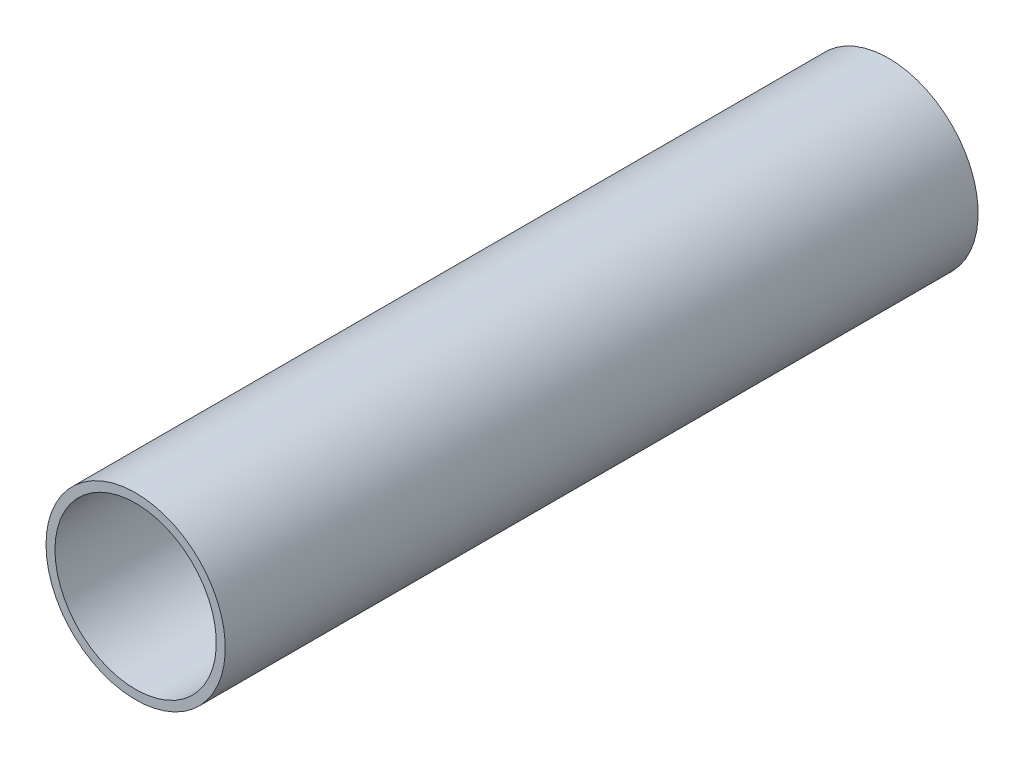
ISO-10303-21;
HEADER;
FILE_DESCRIPTION(('STEP AP214'),'2;1');
FILE_NAME('part.step','',(''),(''),'','','');
FILE_SCHEMA(('AUTOMOTIVE_DESIGN { 1 0 10303 214 1 1 1 1 }'));
ENDSEC;
DATA;
#1=APPLICATION_CONTEXT('core data for automotive mechanical design processes');
#2=APPLICATION_PROTOCOL_DEFINITION('international standard','automotive_design',2000,#1);
#3=PRODUCT_CONTEXT('',#1,'mechanical');
#4=PRODUCT('Part','Part','',(#3));
#5=PRODUCT_RELATED_PRODUCT_CATEGORY('part','',(#4));
#6=PRODUCT_DEFINITION_FORMATION('','',#4);
#7=PRODUCT_DEFINITION_CONTEXT('part definition',#1,'design');
#8=PRODUCT_DEFINITION('design','',#6,#7);
#9=PRODUCT_DEFINITION_SHAPE('','',#8);
#10=(LENGTH_UNIT() NAMED_UNIT(*) SI_UNIT(.MILLI.,.METRE.));
#11=(NAMED_UNIT(*) PLANE_ANGLE_UNIT() SI_UNIT($,.RADIAN.));
#12=(NAMED_UNIT(*) SI_UNIT($,.STERADIAN.) SOLID_ANGLE_UNIT());
#13=UNCERTAINTY_MEASURE_WITH_UNIT(LENGTH_MEASURE(1.E-05),#10,'distance_accuracy_value','');
#14=(GEOMETRIC_REPRESENTATION_CONTEXT(3) GLOBAL_UNCERTAINTY_ASSIGNED_CONTEXT((#13)) GLOBAL_UNIT_ASSIGNED_CONTEXT((#10,
#11,#12)) REPRESENTATION_CONTEXT('',''));
#15=CARTESIAN_POINT('',(0.,0.,0.));
#16=DIRECTION('',(0.,0.,1.));
#17=DIRECTION('',(1.,0.,0.));
#18=AXIS2_PLACEMENT_3D('',#15,#16,#17);
#19=CARTESIAN_POINT('',(0.,0.,84.));
#20=DIRECTION('',(0.,0.,1.));
#21=DIRECTION('',(1.,0.,0.));
#22=AXIS2_PLACEMENT_3D('',#19,#20,#21);
#23=PLANE('',#22);
#24=CARTESIAN_POINT('',(0.,0.,84.));
#25=DIRECTION('',(0.,0.,1.));
#26=DIRECTION('',(1.,0.,0.));
#27=AXIS2_PLACEMENT_3D('',#24,#25,#26);
#28=CIRCLE('',#27,10.);
#29=CARTESIAN_POINT('',(-10.,0.,84.));
#30=VERTEX_POINT('',#29);
#31=EDGE_CURVE('E10',#30,#30,#28,.T.);
#32=ORIENTED_EDGE('',*,*,#31,.T.);
#33=EDGE_LOOP('',(#32));
#34=FACE_BOUND('',#33,.T.);
#35=CARTESIAN_POINT('',(0.,0.,84.));
#36=DIRECTION('',(0.,0.,1.));
#37=DIRECTION('',(1.,0.,0.));
#38=AXIS2_PLACEMENT_3D('',#35,#36,#37);
#39=CIRCLE('',#38,9.);
#40=CARTESIAN_POINT('',(-9.,0.,84.));
#41=VERTEX_POINT('',#40);
#42=EDGE_CURVE('E43',#41,#41,#39,.T.);
#43=ORIENTED_EDGE('',*,*,#42,.F.);
#44=EDGE_LOOP('',(#43));
#45=FACE_BOUND('',#44,.T.);
#46=ADVANCED_FACE('F32',(#34,#45),#23,.T.);
#47=CARTESIAN_POINT('',(0.,0.,0.));
#48=DIRECTION('',(0.,0.,1.));
#49=DIRECTION('',(1.,0.,0.));
#50=AXIS2_PLACEMENT_3D('',#47,#48,#49);
#51=PLANE('',#50);
#52=CARTESIAN_POINT('',(0.,0.,0.));
#53=DIRECTION('',(0.,0.,1.));
#54=DIRECTION('',(1.,0.,0.));
#55=AXIS2_PLACEMENT_3D('',#52,#53,#54);
#56=CIRCLE('',#55,10.);
#57=CARTESIAN_POINT('',(-10.,0.,0.));
#58=VERTEX_POINT('',#57);
#59=EDGE_CURVE('E36',#58,#58,#56,.T.);
#60=ORIENTED_EDGE('',*,*,#59,.F.);
#61=EDGE_LOOP('',(#60));
#62=FACE_BOUND('',#61,.T.);
#63=CARTESIAN_POINT('',(0.,0.,0.));
#64=DIRECTION('',(0.,0.,1.));
#65=DIRECTION('',(1.,0.,0.));
#66=AXIS2_PLACEMENT_3D('',#63,#64,#65);
#67=CIRCLE('',#66,9.);
#68=CARTESIAN_POINT('',(-9.,0.,0.));
#69=VERTEX_POINT('',#68);
#70=EDGE_CURVE('E45',#69,#69,#67,.T.);
#71=ORIENTED_EDGE('',*,*,#70,.T.);
#72=EDGE_LOOP('',(#71));
#73=FACE_BOUND('',#72,.T.);
#74=ADVANCED_FACE('F55',(#62,#73),#51,.F.);
#75=CARTESIAN_POINT('',(0.,0.,84.));
#76=DIRECTION('',(0.,0.,-1.));
#77=DIRECTION('',(-1.,0.,0.));
#78=AXIS2_PLACEMENT_3D('',#75,#76,#77);
#79=CYLINDRICAL_SURFACE('',#78,10.);
#80=CARTESIAN_POINT('',(-10.,0.,84.));
#81=CARTESIAN_POINT('',(-10.,0.,83.125));
#82=CARTESIAN_POINT('',(-10.,0.,82.25));
#83=CARTESIAN_POINT('',(-10.,0.,80.5));
#84=CARTESIAN_POINT('',(-10.,0.,79.625));
#85=CARTESIAN_POINT('',(-10.,0.,77.875));
#86=CARTESIAN_POINT('',(-10.,0.,77.));
#87=CARTESIAN_POINT('',(-10.,0.,75.25));
#88=CARTESIAN_POINT('',(-10.,0.,74.375));
#89=CARTESIAN_POINT('',(-10.,0.,72.625));
#90=CARTESIAN_POINT('',(-10.,0.,71.75));
#91=CARTESIAN_POINT('',(-10.,0.,70.));
#92=CARTESIAN_POINT('',(-10.,0.,69.125));
#93=CARTESIAN_POINT('',(-10.,0.,67.375));
#94=CARTESIAN_POINT('',(-10.,0.,66.5));
#95=CARTESIAN_POINT('',(-10.,0.,64.75));
#96=CARTESIAN_POINT('',(-10.,0.,63.875));
#97=CARTESIAN_POINT('',(-10.,0.,62.125));
#98=CARTESIAN_POINT('',(-10.,0.,61.25));
#99=CARTESIAN_POINT('',(-10.,0.,59.5));
#100=CARTESIAN_POINT('',(-10.,0.,58.625));
#101=CARTESIAN_POINT('',(-10.,0.,56.875));
#102=CARTESIAN_POINT('',(-10.,0.,56.));
#103=CARTESIAN_POINT('',(-10.,0.,54.25));
#104=CARTESIAN_POINT('',(-10.,0.,53.375));
#105=CARTESIAN_POINT('',(-10.,0.,51.625));
#106=CARTESIAN_POINT('',(-10.,0.,50.75));
#107=CARTESIAN_POINT('',(-10.,0.,49.));
#108=CARTESIAN_POINT('',(-10.,0.,48.125));
#109=CARTESIAN_POINT('',(-10.,0.,46.375));
#110=CARTESIAN_POINT('',(-10.,0.,45.5));
#111=CARTESIAN_POINT('',(-10.,0.,43.75));
#112=CARTESIAN_POINT('',(-10.,0.,42.875));
#113=CARTESIAN_POINT('',(-10.,0.,41.125));
#114=CARTESIAN_POINT('',(-10.,0.,40.25));
#115=CARTESIAN_POINT('',(-10.,0.,38.5));
#116=CARTESIAN_POINT('',(-10.,0.,37.625));
#117=CARTESIAN_POINT('',(-10.,0.,35.875));
#118=CARTESIAN_POINT('',(-10.,0.,35.));
#119=CARTESIAN_POINT('',(-10.,0.,33.25));
#120=CARTESIAN_POINT('',(-10.,0.,32.375));
#121=CARTESIAN_POINT('',(-10.,0.,30.625));
#122=CARTESIAN_POINT('',(-10.,0.,29.75));
#123=CARTESIAN_POINT('',(-10.,0.,28.));
#124=CARTESIAN_POINT('',(-10.,0.,27.125));
#125=CARTESIAN_POINT('',(-10.,0.,25.375));
#126=CARTESIAN_POINT('',(-10.,0.,24.5));
#127=CARTESIAN_POINT('',(-10.,0.,22.75));
#128=CARTESIAN_POINT('',(-10.,0.,21.875));
#129=CARTESIAN_POINT('',(-10.,0.,20.125));
#130=CARTESIAN_POINT('',(-10.,0.,19.25));
#131=CARTESIAN_POINT('',(-10.,0.,17.5));
#132=CARTESIAN_POINT('',(-10.,0.,16.625));
#133=CARTESIAN_POINT('',(-10.,0.,14.875));
#134=CARTESIAN_POINT('',(-10.,0.,14.));
#135=CARTESIAN_POINT('',(-10.,0.,12.25));
#136=CARTESIAN_POINT('',(-10.,0.,11.375));
#137=CARTESIAN_POINT('',(-10.,0.,9.62500000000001));
#138=CARTESIAN_POINT('',(-10.,0.,8.75000000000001));
#139=CARTESIAN_POINT('',(-10.,0.,7.00000000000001));
#140=CARTESIAN_POINT('',(-10.,0.,6.12500000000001));
#141=CARTESIAN_POINT('',(-10.,0.,4.375));
#142=CARTESIAN_POINT('',(-10.,0.,3.5));
#143=CARTESIAN_POINT('',(-10.,0.,1.75));
#144=CARTESIAN_POINT('',(-10.,0.,0.875));
#145=CARTESIAN_POINT('',(-10.,0.,0.));
#146=B_SPLINE_CURVE_WITH_KNOTS('',3,(#80,#81,#82,#83,#84,#85,#86,#87,#88,#89,#90,#91,#92,#93,
#94,#95,#96,#97,#98,#99,#100,#101,#102,#103,#104,#105,#106,#107,#108,#109,#110,#111,#112,#113,
#114,#115,#116,#117,#118,#119,#120,#121,#122,#123,#124,#125,#126,#127,#128,#129,#130,#131,#132,
#133,#134,#135,#136,#137,#138,#139,#140,#141,#142,#143,#144,#145),.UNSPECIFIED.,.F.,.F.,(4,2,2,
2,2,2,2,2,2,2,2,2,2,2,2,2,2,2,2,2,2,2,2,2,2,2,2,2,2,2,2,2,4),(0.,2.625,5.25,7.87500000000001,
10.5,13.125,15.75,18.375,21.,23.625,26.25,28.875,31.5,34.125,36.75,39.375,42.,44.625,47.25,
49.875,52.5,55.125,57.75,60.375,63.,65.625,68.25,70.875,73.5,76.125,78.75,81.375,84.),.UNSPECIFIED.);
#147=EDGE_CURVE('BSEAM34',#30,#58,#146,.T.);
#148=ORIENTED_EDGE('',*,*,#31,.F.);
#149=ORIENTED_EDGE('',*,*,#59,.T.);
#150=ORIENTED_EDGE('',*,*,#147,.T.);
#151=ORIENTED_EDGE('',*,*,#147,.F.);
#152=EDGE_LOOP('',(#148,#150,#149,#151));
#153=FACE_BOUND('',#152,.T.);
#154=ADVANCED_FACE('F34',(#153),#79,.T.);
#155=CARTESIAN_POINT('',(0.,0.,84.));
#156=DIRECTION('',(0.,0.,-1.));
#157=DIRECTION('',(-1.,0.,0.));
#158=AXIS2_PLACEMENT_3D('',#155,#156,#157);
#159=CYLINDRICAL_SURFACE('',#158,9.);
#160=CARTESIAN_POINT('',(-9.,0.,84.));
#161=CARTESIAN_POINT('',(-9.,0.,83.125));
#162=CARTESIAN_POINT('',(-9.,0.,82.25));
#163=CARTESIAN_POINT('',(-9.,0.,80.5));
#164=CARTESIAN_POINT('',(-9.,0.,79.625));
#165=CARTESIAN_POINT('',(-9.,0.,77.875));
#166=CARTESIAN_POINT('',(-9.,0.,77.));
#167=CARTESIAN_POINT('',(-9.,0.,75.25));
#168=CARTESIAN_POINT('',(-9.,0.,74.375));
#169=CARTESIAN_POINT('',(-9.,0.,72.625));
#170=CARTESIAN_POINT('',(-9.,0.,71.75));
#171=CARTESIAN_POINT('',(-9.,0.,70.));
#172=CARTESIAN_POINT('',(-9.,0.,69.125));
#173=CARTESIAN_POINT('',(-9.,0.,67.375));
#174=CARTESIAN_POINT('',(-9.,0.,66.5));
#175=CARTESIAN_POINT('',(-9.,0.,64.75));
#176=CARTESIAN_POINT('',(-9.,0.,63.875));
#177=CARTESIAN_POINT('',(-9.,0.,62.125));
#178=CARTESIAN_POINT('',(-9.,0.,61.25));
#179=CARTESIAN_POINT('',(-9.,0.,59.5));
#180=CARTESIAN_POINT('',(-9.,0.,58.625));
#181=CARTESIAN_POINT('',(-9.,0.,56.875));
#182=CARTESIAN_POINT('',(-9.,0.,56.));
#183=CARTESIAN_POINT('',(-9.,0.,54.25));
#184=CARTESIAN_POINT('',(-9.,0.,53.375));
#185=CARTESIAN_POINT('',(-9.,0.,51.625));
#186=CARTESIAN_POINT('',(-9.,0.,50.75));
#187=CARTESIAN_POINT('',(-9.,0.,49.));
#188=CARTESIAN_POINT('',(-9.,0.,48.125));
#189=CARTESIAN_POINT('',(-9.,0.,46.375));
#190=CARTESIAN_POINT('',(-9.,0.,45.5));
#191=CARTESIAN_POINT('',(-9.,0.,43.75));
#192=CARTESIAN_POINT('',(-9.,0.,42.875));
#193=CARTESIAN_POINT('',(-9.,0.,41.125));
#194=CARTESIAN_POINT('',(-9.,0.,40.25));
#195=CARTESIAN_POINT('',(-9.,0.,38.5));
#196=CARTESIAN_POINT('',(-9.,0.,37.625));
#197=CARTESIAN_POINT('',(-9.,0.,35.875));
#198=CARTESIAN_POINT('',(-9.,0.,35.));
#199=CARTESIAN_POINT('',(-9.,0.,33.25));
#200=CARTESIAN_POINT('',(-9.,0.,32.375));
#201=CARTESIAN_POINT('',(-9.,0.,30.625));
#202=CARTESIAN_POINT('',(-9.,0.,29.75));
#203=CARTESIAN_POINT('',(-9.,0.,28.));
#204=CARTESIAN_POINT('',(-9.,0.,27.125));
#205=CARTESIAN_POINT('',(-9.,0.,25.375));
#206=CARTESIAN_POINT('',(-9.,0.,24.5));
#207=CARTESIAN_POINT('',(-9.,0.,22.75));
#208=CARTESIAN_POINT('',(-9.,0.,21.875));
#209=CARTESIAN_POINT('',(-9.,0.,20.125));
#210=CARTESIAN_POINT('',(-9.,0.,19.25));
#211=CARTESIAN_POINT('',(-9.,0.,17.5));
#212=CARTESIAN_POINT('',(-9.,0.,16.625));
#213=CARTESIAN_POINT('',(-9.,0.,14.875));
#214=CARTESIAN_POINT('',(-9.,0.,14.));
#215=CARTESIAN_POINT('',(-9.,0.,12.25));
#216=CARTESIAN_POINT('',(-9.,0.,11.375));
#217=CARTESIAN_POINT('',(-9.,0.,9.625));
#218=CARTESIAN_POINT('',(-9.,0.,8.75));
#219=CARTESIAN_POINT('',(-9.,0.,7.00000000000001));
#220=CARTESIAN_POINT('',(-9.,0.,6.12500000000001));
#221=CARTESIAN_POINT('',(-9.,0.,4.375));
#222=CARTESIAN_POINT('',(-9.,0.,3.5));
#223=CARTESIAN_POINT('',(-9.,0.,1.75));
#224=CARTESIAN_POINT('',(-9.,0.,0.875));
#225=CARTESIAN_POINT('',(-9.,0.,0.));
#226=B_SPLINE_CURVE_WITH_KNOTS('',3,(#160,#161,#162,#163,#164,#165,#166,#167,#168,#169,#170,
#171,#172,#173,#174,#175,#176,#177,#178,#179,#180,#181,#182,#183,#184,#185,#186,#187,#188,#189,
#190,#191,#192,#193,#194,#195,#196,#197,#198,#199,#200,#201,#202,#203,#204,#205,#206,#207,#208,
#209,#210,#211,#212,#213,#214,#215,#216,#217,#218,#219,#220,#221,#222,#223,#224,#225),
.UNSPECIFIED.,.F.,.F.,(4,2,2,2,2,2,2,2,2,2,2,2,2,2,2,2,2,2,2,2,2,2,2,2,2,2,2,2,2,2,2,2,4),(0.,
2.62499999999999,5.24999999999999,7.87499999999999,10.5,13.125,15.75,18.375,21.,23.625,26.25,
28.875,31.5,34.125,36.75,39.375,42.,44.625,47.25,49.875,52.5,55.125,57.75,60.375,63.,65.625,
68.25,70.875,73.5,76.125,78.75,81.375,84.),.UNSPECIFIED.);
#227=EDGE_CURVE('BSEAM51',#41,#69,#226,.T.);
#228=ORIENTED_EDGE('',*,*,#42,.T.);
#229=ORIENTED_EDGE('',*,*,#70,.F.);
#230=ORIENTED_EDGE('',*,*,#227,.T.);
#231=ORIENTED_EDGE('',*,*,#227,.F.);
#232=EDGE_LOOP('',(#228,#230,#229,#231));
#233=FACE_BOUND('',#232,.T.);
#234=ADVANCED_FACE('F51',(#233),#159,.F.);
#235=CLOSED_SHELL('',(#46,#74,#154,#234));
#236=MANIFOLD_SOLID_BREP('B2',#235);
#237=ADVANCED_BREP_SHAPE_REPRESENTATION('',(#18,#236),#14);
#238=SHAPE_DEFINITION_REPRESENTATION(#9,#237);
ENDSEC;
END-ISO-10303-21;
